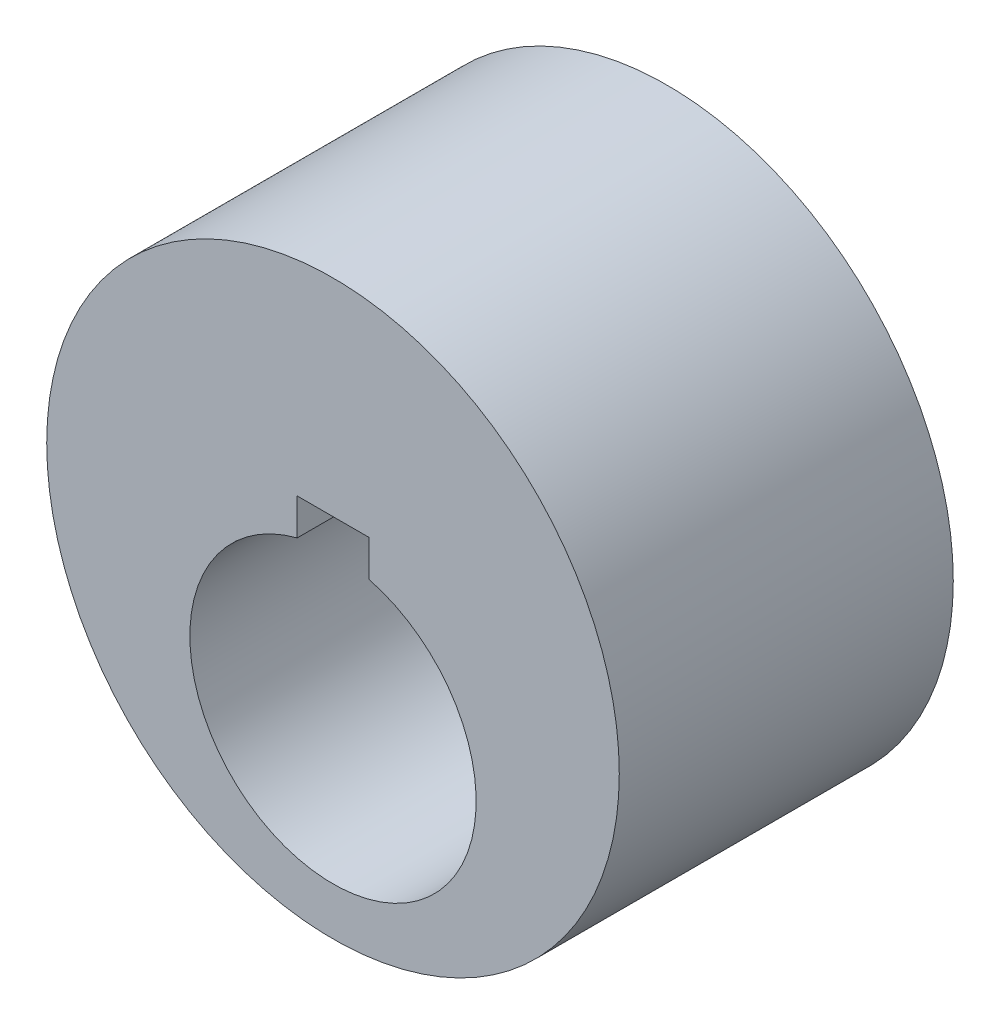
from build123d import *

# Parameters (mm, degrees)
ESQUISSE1_W                        = 36
ESQUISSE1_H                        = 42
ENL_V_MAT_EXTRU_1_REACH            = 75.239
ESQUISSE3_W                        = 18
ESQUISSE3_H                        = 42
DIAM_TRE_DU_PER_AGE_M6_0_6_1_D     = 6
DIAM_TRE_DU_PER_AGE_M6_0_6_1_DEPTH = 14
DIAM_TRE_DU_PER_AGE_M6_0_6_1_TIP   = 1.732050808


with BuildPart() as part:
    # Esquisse1 → R_volution1 (revolve)
    with BuildSketch(Plane.XZ.offset(-12), mode=Mode.PRIVATE) as r_volution1_sk:
        with Locations((18, 21)):
            Rectangle(ESQUISSE1_W, ESQUISSE1_H)
    revolve(r_volution1_sk.sketch.rotate(Axis((0, 12, 42), (0, 0, -1)), 180), axis=Axis((0, 12, 42), (0, 0, -1)))

    # Esquisse2 → Enl_v. mat.-Extru.1 (cut, up to next)
    with BuildSketch(Plane(origin=(0, 0, 0), x_dir=(-1, 0, 0), z_dir=(0, 0, -1)), mode=Mode.PRIVATE) as enl_v_mat_extru_1_sk1:
        with BuildLine():
            Line((4.5, 22), (-4.5, 22))
            Line((-4.5, 22), (-4.5, 17.428425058))
            ThreePointArc((-4.5, 17.428425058), (0, 18), (4.5, 17.428425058))
            Line((4.5, 17.428425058), (4.5, 22))
        make_face()
    enl_v_mat_extru_1_tool1 = extrude(enl_v_mat_extru_1_sk1.sketch, amount=-ENL_V_MAT_EXTRU_1_REACH, mode=Mode.PRIVATE) & part.part
    add(enl_v_mat_extru_1_tool1.solids().sort_by_distance((0, 19.901901, 0))[0], mode=Mode.SUBTRACT)

    # Esquisse3 → Enl_vement de mati_re-R_volution1 (revolve, cut)
    with BuildSketch(Plane(origin=(0, 0, 0), x_dir=(1, 0, 0), z_dir=(0, 1, 0))):
        with Locations((9, -21)):
            Rectangle(ESQUISSE3_W, ESQUISSE3_H)
    revolve(axis=Axis((0, 0, 0), (0, 0, 1)), mode=Mode.SUBTRACT)

    # Diam_tre du per_age M6.0 _6_1
    with Locations(Plane(origin=(0, 0, 0), x_dir=(-1, 0, 0), z_dir=(0, 0, -1))):
        with Locations((0, 42)):
            Hole(DIAM_TRE_DU_PER_AGE_M6_0_6_1_D / 2, depth=DIAM_TRE_DU_PER_AGE_M6_0_6_1_DEPTH)
            with Locations((0, 0, -(DIAM_TRE_DU_PER_AGE_M6_0_6_1_DEPTH + DIAM_TRE_DU_PER_AGE_M6_0_6_1_TIP / 2))):  # 120° drill point
                Cone(0, DIAM_TRE_DU_PER_AGE_M6_0_6_1_D / 2, DIAM_TRE_DU_PER_AGE_M6_0_6_1_TIP, mode=Mode.SUBTRACT)


solid = part.part
